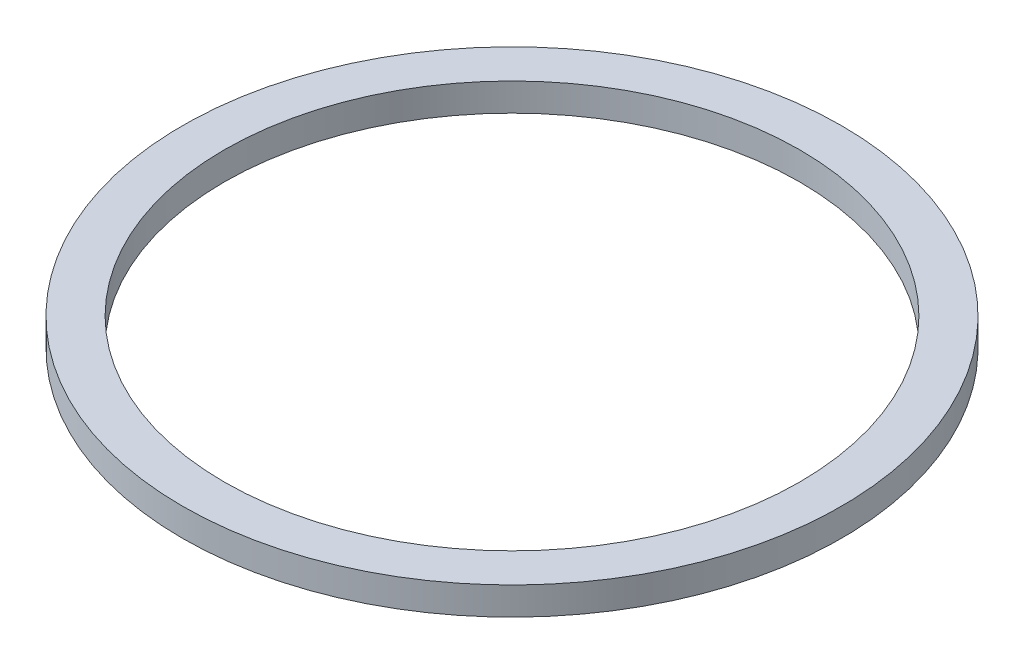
from build123d import *

# Parameters (mm, degrees)
SCHIZZO1_R        = 16.55
SCHIZZO1_R_2      = 14.45
ESTRUSIONE1_DEPTH = 1.4


with BuildPart() as part:
    # Schizzo1 → Estrusione1 (new body)
    with BuildSketch(Plane(origin=(0, 0, 0), x_dir=(1, 0, 0), z_dir=(0, 1, 0))):
        with Locations(Location((0, 0, 0), (0, 0, 270))):
            Circle(SCHIZZO1_R)
        with Locations(Location((0, 0, 0), (0, 0, 270))):
            Circle(SCHIZZO1_R_2, mode=Mode.SUBTRACT)
    extrude(amount=ESTRUSIONE1_DEPTH)


solid = part.part
